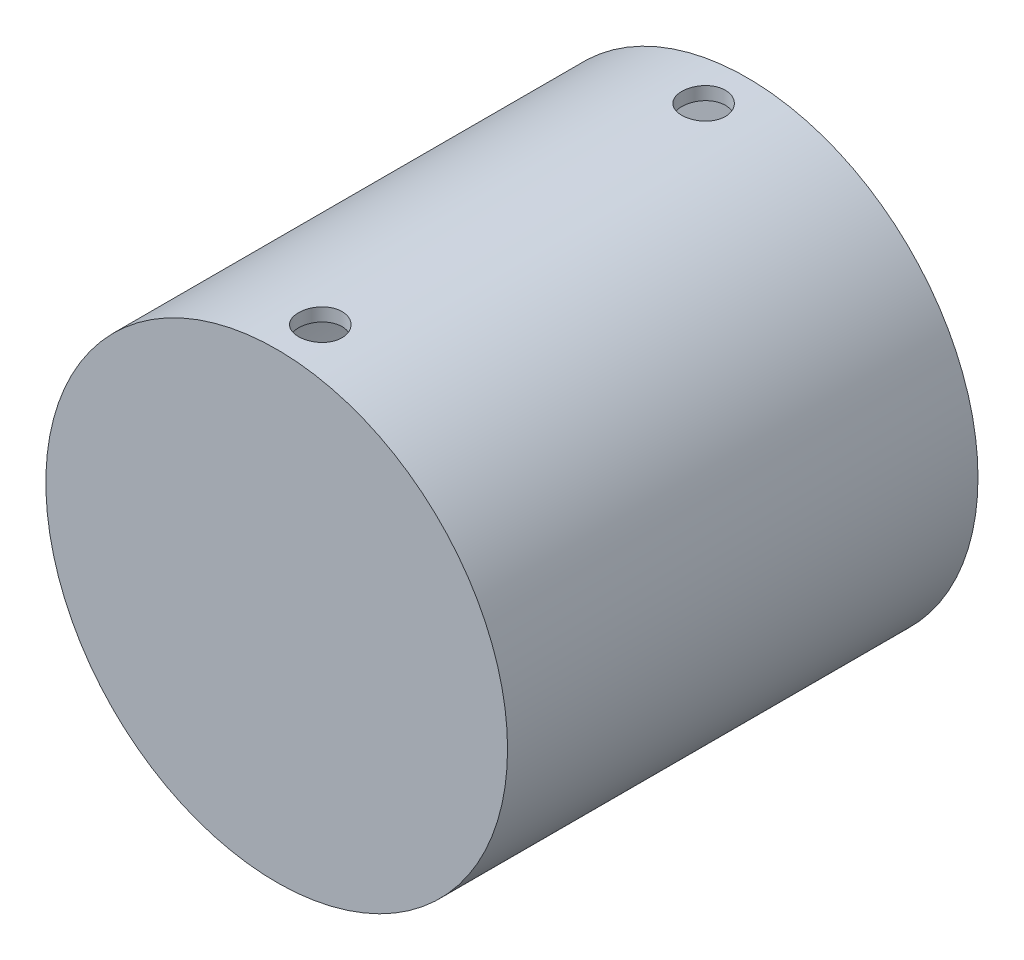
ISO-10303-21;
HEADER;
FILE_DESCRIPTION(('STEP AP214'),'2;1');
FILE_NAME('part.step','',(''),(''),'','','');
FILE_SCHEMA(('AUTOMOTIVE_DESIGN { 1 0 10303 214 1 1 1 1 }'));
ENDSEC;
DATA;
#1=APPLICATION_CONTEXT('core data for automotive mechanical design processes');
#2=APPLICATION_PROTOCOL_DEFINITION('international standard','automotive_design',2000,#1);
#3=PRODUCT_CONTEXT('',#1,'mechanical');
#4=PRODUCT('Part','Part','',(#3));
#5=PRODUCT_RELATED_PRODUCT_CATEGORY('part','',(#4));
#6=PRODUCT_DEFINITION_FORMATION('','',#4);
#7=PRODUCT_DEFINITION_CONTEXT('part definition',#1,'design');
#8=PRODUCT_DEFINITION('design','',#6,#7);
#9=PRODUCT_DEFINITION_SHAPE('','',#8);
#10=(LENGTH_UNIT() NAMED_UNIT(*) SI_UNIT(.MILLI.,.METRE.));
#11=(NAMED_UNIT(*) PLANE_ANGLE_UNIT() SI_UNIT($,.RADIAN.));
#12=(NAMED_UNIT(*) SI_UNIT($,.STERADIAN.) SOLID_ANGLE_UNIT());
#13=UNCERTAINTY_MEASURE_WITH_UNIT(LENGTH_MEASURE(1.E-05),#10,'distance_accuracy_value','');
#14=(GEOMETRIC_REPRESENTATION_CONTEXT(3) GLOBAL_UNCERTAINTY_ASSIGNED_CONTEXT((#13)) GLOBAL_UNIT_ASSIGNED_CONTEXT((#10,
#11,#12)) REPRESENTATION_CONTEXT('',''));
#15=CARTESIAN_POINT('',(0.,0.,0.));
#16=DIRECTION('',(0.,0.,1.));
#17=DIRECTION('',(1.,0.,0.));
#18=AXIS2_PLACEMENT_3D('',#15,#16,#17);
#19=CARTESIAN_POINT('',(0.,0.,-100.));
#20=DIRECTION('',(0.,0.,1.));
#21=DIRECTION('',(1.,0.,0.));
#22=AXIS2_PLACEMENT_3D('',#19,#20,#21);
#23=CYLINDRICAL_SURFACE('',#22,53.);
#24=CARTESIAN_POINT('',(0.,53.,-11.));
#25=CARTESIAN_POINT('',(0.140141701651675,53.0000003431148,-11.0000013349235));
#26=CARTESIAN_POINT('',(0.280262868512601,52.9994430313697,-10.9941058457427));
#27=CARTESIAN_POINT('',(0.559551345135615,52.9972300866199,-10.9705673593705));
#28=CARTESIAN_POINT('',(0.698718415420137,52.9955741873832,-10.9529215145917));
#29=CARTESIAN_POINT('',(0.975171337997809,52.9912084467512,-10.9059878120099));
#30=CARTESIAN_POINT('',(1.11245557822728,52.9884977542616,-10.8766905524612));
#31=CARTESIAN_POINT('',(1.38410498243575,52.9820980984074,-10.8066552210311));
#32=CARTESIAN_POINT('',(1.51846905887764,52.9784087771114,-10.7659129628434));
#33=CARTESIAN_POINT('',(1.78314487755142,52.9701605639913,-10.6733319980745));
#34=CARTESIAN_POINT('',(1.91346039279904,52.965602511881,-10.621504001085));
#35=CARTESIAN_POINT('',(2.16930312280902,52.9557411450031,-10.507079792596));
#36=CARTESIAN_POINT('',(2.2948285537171,52.9504375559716,-10.4444796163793));
#37=CARTESIAN_POINT('',(2.5400873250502,52.9392389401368,-10.3090104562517));
#38=CARTESIAN_POINT('',(2.65982396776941,52.9333442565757,-10.2361474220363));
#39=CARTESIAN_POINT('',(2.89278819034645,52.9211242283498,-10.0806126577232));
#40=CARTESIAN_POINT('',(3.00601334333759,52.9147987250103,-9.99793730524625));
#41=CARTESIAN_POINT('',(3.22538889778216,52.9018806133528,-9.82316403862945));
#42=CARTESIAN_POINT('',(3.33152095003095,52.895287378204,-9.73104313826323));
#43=CARTESIAN_POINT('',(3.53569271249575,52.8820323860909,-9.53816428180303));
#44=CARTESIAN_POINT('',(3.63372941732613,52.8753706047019,-9.43740314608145));
#45=CARTESIAN_POINT('',(3.82094665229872,52.862171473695,-9.22801542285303));
#46=CARTESIAN_POINT('',(3.91013003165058,52.8556340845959,-9.11939138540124));
#47=CARTESIAN_POINT('',(4.07907835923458,52.8428642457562,-8.89497053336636));
#48=CARTESIAN_POINT('',(4.15883981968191,52.8366319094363,-8.77917108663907));
#49=CARTESIAN_POINT('',(4.30845347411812,52.8246426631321,-8.54106803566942));
#50=CARTESIAN_POINT('',(4.37829044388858,52.8188864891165,-8.41875482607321));
#51=CARTESIAN_POINT('',(4.50743436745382,52.8080224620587,-8.16860766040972));
#52=CARTESIAN_POINT('',(4.56673741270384,52.8029148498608,-8.04077167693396));
#53=CARTESIAN_POINT('',(4.67433288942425,52.7934990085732,-7.78056574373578));
#54=CARTESIAN_POINT('',(4.72262957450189,52.7891904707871,-7.64819756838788));
#55=CARTESIAN_POINT('',(4.80790479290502,52.7814916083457,-7.37982401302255));
#56=CARTESIAN_POINT('',(4.84487915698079,52.7781016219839,-7.24381731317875));
#57=CARTESIAN_POINT('',(4.93813690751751,52.7694885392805,-6.83270944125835));
#58=CARTESIAN_POINT('',(4.97719749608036,52.7657822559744,-6.55344700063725));
#59=CARTESIAN_POINT('',(5.00789070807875,52.7628774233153,-5.99245917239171));
#60=CARTESIAN_POINT('',(4.99952444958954,52.7636787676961,-5.71073384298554));
#61=CARTESIAN_POINT('',(4.93577813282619,52.7696797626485,-5.15358850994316));
#62=CARTESIAN_POINT('',(4.88054965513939,52.7748652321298,-4.87815111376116));
#63=CARTESIAN_POINT('',(4.72486582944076,52.7890300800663,-4.34048350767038));
#64=CARTESIAN_POINT('',(4.62440993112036,52.7980095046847,-4.07825345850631));
#65=CARTESIAN_POINT('',(4.38095903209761,52.8187662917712,-3.57395054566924));
#66=CARTESIAN_POINT('',(4.23789649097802,52.8305480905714,-3.33191047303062));
#67=CARTESIAN_POINT('',(3.91334073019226,52.8555783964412,-2.87522048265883));
#68=CARTESIAN_POINT('',(3.73184651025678,52.8688269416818,-2.66057127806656));
#69=CARTESIAN_POINT('',(3.33473153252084,52.8953611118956,-2.26387390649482));
#70=CARTESIAN_POINT('',(3.11897978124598,52.908646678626,-2.08195684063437));
#71=CARTESIAN_POINT('',(2.65992968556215,52.933708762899,-1.75690320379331));
#72=CARTESIAN_POINT('',(2.41663131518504,52.9454852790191,-1.61376666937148));
#73=CARTESIAN_POINT('',(1.90930553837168,52.9662056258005,-1.37034344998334));
#74=CARTESIAN_POINT('',(1.64527506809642,52.975149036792,-1.27006311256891));
#75=CARTESIAN_POINT('',(1.10402142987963,52.9891910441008,-1.11529343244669));
#76=CARTESIAN_POINT('',(0.826798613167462,52.9942897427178,-1.06080287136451));
#77=CARTESIAN_POINT('',(0.268165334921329,53.000054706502,-0.999325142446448));
#78=CARTESIAN_POINT('',(-0.0132250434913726,53.0007378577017,-0.992157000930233));
#79=CARTESIAN_POINT('',(-0.573203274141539,52.9976399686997,-1.02505271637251));
#80=CARTESIAN_POINT('',(-0.85179115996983,52.9938589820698,-1.06511600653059));
#81=CARTESIAN_POINT('',(-1.39773625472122,52.9822686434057,-1.1911872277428));
#82=CARTESIAN_POINT('',(-1.66511313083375,52.9744666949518,-1.27711072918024));
#83=CARTESIAN_POINT('',(-2.18165692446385,52.9557101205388,-1.4923768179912));
#84=CARTESIAN_POINT('',(-2.43082347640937,52.9447554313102,-1.62172027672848));
#85=CARTESIAN_POINT('',(-2.90469389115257,52.9208775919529,-1.92060539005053));
#86=CARTESIAN_POINT('',(-3.12932223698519,52.9079486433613,-2.09026630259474));
#87=CARTESIAN_POINT('',(-3.54697610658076,52.8815926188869,-2.46479982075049));
#88=CARTESIAN_POINT('',(-3.74000092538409,52.8681655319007,-2.66967321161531));
#89=CARTESIAN_POINT('',(-4.08959449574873,52.8422759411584,-3.10960043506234));
#90=CARTESIAN_POINT('',(-4.24604471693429,52.8298166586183,-3.34474866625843));
#91=CARTESIAN_POINT('',(-4.5172325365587,52.8073215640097,-3.83809742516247));
#92=CARTESIAN_POINT('',(-4.63197065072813,52.797285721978,-4.09629766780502));
#93=CARTESIAN_POINT('',(-4.81628292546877,52.7807920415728,-4.62795746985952));
#94=CARTESIAN_POINT('',(-4.8859283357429,52.7743285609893,-4.9013922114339));
#95=CARTESIAN_POINT('',(-4.97828978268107,52.7656979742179,-5.45629207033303));
#96=CARTESIAN_POINT('',(-5.00100700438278,52.76353075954,-5.73775698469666));
#97=CARTESIAN_POINT('',(-4.99944473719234,52.7636752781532,-6.15898206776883));
#98=CARTESIAN_POINT('',(-4.99301883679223,52.7642860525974,-6.29902872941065));
#99=CARTESIAN_POINT('',(-4.9684421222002,52.7666065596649,-6.57806624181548));
#100=CARTESIAN_POINT('',(-4.95029565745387,52.76831588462,-6.71705746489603));
#101=CARTESIAN_POINT('',(-4.90239591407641,52.7727873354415,-6.99305036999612));
#102=CARTESIAN_POINT('',(-4.87263837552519,52.7755498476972,-7.13005130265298));
#103=CARTESIAN_POINT('',(-4.80174860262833,52.7820469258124,-7.40100314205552));
#104=CARTESIAN_POINT('',(-4.76062053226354,52.7857811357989,-7.53495514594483));
#105=CARTESIAN_POINT('',(-4.66726936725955,52.7941170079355,-7.79894527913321));
#106=CARTESIAN_POINT('',(-4.61504344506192,52.7987188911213,-7.92898240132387));
#107=CARTESIAN_POINT('',(-4.49989878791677,52.8086569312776,-8.18414634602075));
#108=CARTESIAN_POINT('',(-4.436983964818,52.8139928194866,-8.30927494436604));
#109=CARTESIAN_POINT('',(-4.30087198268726,52.8252511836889,-8.55383861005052));
#110=CARTESIAN_POINT('',(-4.22767121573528,52.8311738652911,-8.67327165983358));
#111=CARTESIAN_POINT('',(-4.07155037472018,52.8434348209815,-8.90552041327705));
#112=CARTESIAN_POINT('',(-3.98863384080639,52.8497729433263,-9.01833850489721));
#113=CARTESIAN_POINT('',(-3.81328003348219,52.86271515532,-9.237070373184));
#114=CARTESIAN_POINT('',(-3.72080478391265,52.8693202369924,-9.34295364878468));
#115=CARTESIAN_POINT('',(-3.52730752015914,52.8825821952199,-9.54652151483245));
#116=CARTESIAN_POINT('',(-3.42628864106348,52.8892390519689,-9.64420908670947));
#117=CARTESIAN_POINT('',(-3.21632048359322,52.9024229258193,-9.83079887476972));
#118=CARTESIAN_POINT('',(-3.10736641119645,52.9089498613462,-9.91969570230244));
#119=CARTESIAN_POINT('',(-2.88238980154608,52.9216828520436,-10.0879769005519));
#120=CARTESIAN_POINT('',(-2.76636988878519,52.9278890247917,-10.1673647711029));
#121=CARTESIAN_POINT('',(-2.52772365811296,52.9398235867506,-10.3163003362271));
#122=CARTESIAN_POINT('',(-2.40508062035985,52.9455506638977,-10.3858213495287));
#123=CARTESIAN_POINT('',(-2.15438721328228,52.9563438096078,-10.514249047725));
#124=CARTESIAN_POINT('',(-2.02633884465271,52.961410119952,-10.5731596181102));
#125=CARTESIAN_POINT('',(-1.76580681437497,52.9707362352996,-10.679928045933));
#126=CARTESIAN_POINT('',(-1.63332692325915,52.9749967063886,-10.7277950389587));
#127=CARTESIAN_POINT('',(-1.36482159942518,52.9825943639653,-10.812179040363));
#128=CARTESIAN_POINT('',(-1.22879705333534,52.9859317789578,-10.8486988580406));
#129=CARTESIAN_POINT('',(-0.912528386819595,52.9924454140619,-10.9194397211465));
#130=CARTESIAN_POINT('',(-0.731358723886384,52.9952672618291,-10.9496211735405));
#131=CARTESIAN_POINT('',(-0.366780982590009,52.9990443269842,-10.9899004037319));
#132=CARTESIAN_POINT('',(-0.183372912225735,52.9999995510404,-10.9999982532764));
#133=CARTESIAN_POINT('',(0.,53.,-11.));
#134=B_SPLINE_CURVE_WITH_KNOTS('',3,(#24,#25,#26,#27,#28,#29,#30,#31,#32,#33,#34,#35,#36,#37,
#38,#39,#40,#41,#42,#43,#44,#45,#46,#47,#48,#49,#50,#51,#52,#53,#54,#55,#56,#57,#58,#59,#60,#61,
#62,#63,#64,#65,#66,#67,#68,#69,#70,#71,#72,#73,#74,#75,#76,#77,#78,#79,#80,#81,#82,#83,#84,#85,
#86,#87,#88,#89,#90,#91,#92,#93,#94,#95,#96,#97,#98,#99,#100,#101,#102,#103,#104,#105,#106,#107,
#108,#109,#110,#111,#112,#113,#114,#115,#116,#117,#118,#119,#120,#121,#122,#123,#124,#125,#126,
#127,#128,#129,#130,#131,#132,#133),.UNSPECIFIED.,.T.,.F.,(4,2,2,2,2,2,2,2,2,2,2,2,2,2,2,2,2,2,
2,2,2,2,2,2,2,2,2,2,2,2,2,2,2,2,2,2,2,2,2,2,2,2,2,2,2,2,2,2,2,2,2,2,2,2,4),(0.,
0.420264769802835,0.840631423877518,1.26133797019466,1.68219860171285,2.10265447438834,
2.52326542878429,2.94363353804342,3.36415731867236,3.78572991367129,4.20745831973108,
4.62905056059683,5.05079837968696,5.47318633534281,5.89573068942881,6.31811146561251,
6.74064758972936,7.58227862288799,8.42388981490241,9.262789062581,10.1016985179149,
10.9419449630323,11.7822132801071,12.6257756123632,13.4693387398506,14.3130267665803,
15.1566923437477,15.9971296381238,16.8375568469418,17.6764421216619,18.5153442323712,
19.3567593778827,20.198193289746,21.0423174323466,21.8864311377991,22.7292078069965,
23.5719631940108,23.992140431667,24.4121618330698,24.8323374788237,25.2523594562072,
25.672488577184,26.0924642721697,26.5125876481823,26.9325584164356,27.354266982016,
27.7758214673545,28.1976327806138,28.6192883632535,29.0420632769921,29.4646830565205,
29.8869519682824,30.3091162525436,30.8590271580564,31.4089360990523),.UNSPECIFIED.);
#135=CARTESIAN_POINT('',(0.,53.,-11.));
#136=VERTEX_POINT('',#135);
#137=EDGE_CURVE('E73',#136,#136,#134,.T.);
#138=ORIENTED_EDGE('',*,*,#137,.T.);
#139=EDGE_LOOP('',(#138));
#140=FACE_BOUND('',#139,.T.);
#141=CARTESIAN_POINT('',(0.,0.,4.));
#142=DIRECTION('',(0.,0.,1.));
#143=DIRECTION('',(1.,0.,0.));
#144=AXIS2_PLACEMENT_3D('',#141,#142,#143);
#145=CIRCLE('',#144,53.);
#146=CARTESIAN_POINT('',(53.,0.,4.));
#147=VERTEX_POINT('',#146);
#148=EDGE_CURVE('E56',#147,#147,#145,.T.);
#149=ORIENTED_EDGE('',*,*,#148,.F.);
#150=EDGE_LOOP('',(#149));
#151=FACE_BOUND('',#150,.T.);
#152=CARTESIAN_POINT('',(0.,0.,-104.));
#153=DIRECTION('',(0.,0.,-1.));
#154=DIRECTION('',(-1.,0.,0.));
#155=AXIS2_PLACEMENT_3D('',#152,#153,#154);
#156=CIRCLE('',#155,53.);
#157=CARTESIAN_POINT('',(-53.,0.,-104.));
#158=VERTEX_POINT('',#157);
#159=EDGE_CURVE('E64',#158,#158,#156,.T.);
#160=ORIENTED_EDGE('',*,*,#159,.F.);
#161=EDGE_LOOP('',(#160));
#162=FACE_BOUND('',#161,.T.);
#163=CARTESIAN_POINT('',(0.,53.,-99.));
#164=CARTESIAN_POINT('',(0.140141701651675,53.0000003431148,-99.0000013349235));
#165=CARTESIAN_POINT('',(0.280262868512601,52.9994430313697,-98.9941058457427));
#166=CARTESIAN_POINT('',(0.559551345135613,52.9972300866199,-98.9705673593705));
#167=CARTESIAN_POINT('',(0.698718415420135,52.9955741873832,-98.9529215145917));
#168=CARTESIAN_POINT('',(0.975171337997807,52.9912084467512,-98.9059878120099));
#169=CARTESIAN_POINT('',(1.11245557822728,52.9884977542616,-98.8766905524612));
#170=CARTESIAN_POINT('',(1.38410498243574,52.9820980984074,-98.8066552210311));
#171=CARTESIAN_POINT('',(1.51846905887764,52.9784087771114,-98.7659129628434));
#172=CARTESIAN_POINT('',(1.78314487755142,52.9701605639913,-98.6733319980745));
#173=CARTESIAN_POINT('',(1.91346039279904,52.965602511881,-98.621504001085));
#174=CARTESIAN_POINT('',(2.16930312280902,52.9557411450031,-98.507079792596));
#175=CARTESIAN_POINT('',(2.29482855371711,52.9504375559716,-98.4444796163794));
#176=CARTESIAN_POINT('',(2.5400873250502,52.9392389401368,-98.3090104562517));
#177=CARTESIAN_POINT('',(2.65982396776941,52.9333442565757,-98.2361474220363));
#178=CARTESIAN_POINT('',(2.89278819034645,52.9211242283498,-98.0806126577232));
#179=CARTESIAN_POINT('',(3.00601334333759,52.9147987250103,-97.9979373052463));
#180=CARTESIAN_POINT('',(3.22538889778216,52.9018806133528,-97.8231640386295));
#181=CARTESIAN_POINT('',(3.33152095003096,52.895287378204,-97.7310431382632));
#182=CARTESIAN_POINT('',(3.53569271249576,52.8820323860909,-97.538164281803));
#183=CARTESIAN_POINT('',(3.63372941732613,52.8753706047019,-97.4374031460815));
#184=CARTESIAN_POINT('',(3.82094665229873,52.862171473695,-97.228015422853));
#185=CARTESIAN_POINT('',(3.91013003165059,52.8556340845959,-97.1193913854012));
#186=CARTESIAN_POINT('',(4.07907835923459,52.8428642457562,-96.8949705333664));
#187=CARTESIAN_POINT('',(4.15883981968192,52.8366319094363,-96.7791710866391));
#188=CARTESIAN_POINT('',(4.30845347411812,52.8246426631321,-96.5410680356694));
#189=CARTESIAN_POINT('',(4.37829044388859,52.8188864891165,-96.4187548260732));
#190=CARTESIAN_POINT('',(4.50743436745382,52.8080224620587,-96.1686076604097));
#191=CARTESIAN_POINT('',(4.56673741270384,52.8029148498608,-96.040771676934));
#192=CARTESIAN_POINT('',(4.67433288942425,52.7934990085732,-95.7805657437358));
#193=CARTESIAN_POINT('',(4.72262957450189,52.7891904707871,-95.6481975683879));
#194=CARTESIAN_POINT('',(4.80790479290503,52.7814916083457,-95.3798240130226));
#195=CARTESIAN_POINT('',(4.84487915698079,52.7781016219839,-95.2438173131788));
#196=CARTESIAN_POINT('',(4.93813690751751,52.7694885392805,-94.8327094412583));
#197=CARTESIAN_POINT('',(4.97719749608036,52.7657822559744,-94.5534470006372));
#198=CARTESIAN_POINT('',(5.00789070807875,52.7628774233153,-93.9924591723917));
#199=CARTESIAN_POINT('',(4.99952444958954,52.7636787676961,-93.7107338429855));
#200=CARTESIAN_POINT('',(4.93577813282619,52.7696797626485,-93.1535885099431));
#201=CARTESIAN_POINT('',(4.88054965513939,52.7748652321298,-92.8781511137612));
#202=CARTESIAN_POINT('',(4.72486582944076,52.7890300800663,-92.3404835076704));
#203=CARTESIAN_POINT('',(4.62440993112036,52.7980095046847,-92.0782534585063));
#204=CARTESIAN_POINT('',(4.38095903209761,52.8187662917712,-91.5739505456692));
#205=CARTESIAN_POINT('',(4.23789649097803,52.8305480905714,-91.3319104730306));
#206=CARTESIAN_POINT('',(3.91334073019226,52.8555783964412,-90.8752204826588));
#207=CARTESIAN_POINT('',(3.73184651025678,52.8688269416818,-90.6605712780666));
#208=CARTESIAN_POINT('',(3.33473153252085,52.8953611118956,-90.2638739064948));
#209=CARTESIAN_POINT('',(3.11897978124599,52.908646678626,-90.0819568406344));
#210=CARTESIAN_POINT('',(2.65992968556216,52.933708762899,-89.7569032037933));
#211=CARTESIAN_POINT('',(2.41663131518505,52.9454852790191,-89.6137666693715));
#212=CARTESIAN_POINT('',(1.9093055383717,52.9662056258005,-89.3703434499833));
#213=CARTESIAN_POINT('',(1.64527506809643,52.975149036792,-89.2700631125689));
#214=CARTESIAN_POINT('',(1.10402142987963,52.9891910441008,-89.1152934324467));
#215=CARTESIAN_POINT('',(0.82679861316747,52.9942897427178,-89.0608028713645));
#216=CARTESIAN_POINT('',(0.268165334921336,53.000054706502,-88.9993251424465));
#217=CARTESIAN_POINT('',(-0.0132250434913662,53.0007378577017,-88.9921570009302));
#218=CARTESIAN_POINT('',(-0.573203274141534,52.9976399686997,-89.0250527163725));
#219=CARTESIAN_POINT('',(-0.851791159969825,52.9938589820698,-89.0651160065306));
#220=CARTESIAN_POINT('',(-1.39773625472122,52.9822686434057,-89.1911872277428));
#221=CARTESIAN_POINT('',(-1.66511313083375,52.9744666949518,-89.2771107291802));
#222=CARTESIAN_POINT('',(-2.18165692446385,52.9557101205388,-89.4923768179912));
#223=CARTESIAN_POINT('',(-2.43082347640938,52.9447554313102,-89.6217202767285));
#224=CARTESIAN_POINT('',(-2.90469389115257,52.9208775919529,-89.9206053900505));
#225=CARTESIAN_POINT('',(-3.12932223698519,52.9079486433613,-90.0902663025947));
#226=CARTESIAN_POINT('',(-3.54697610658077,52.8815926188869,-90.4647998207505));
#227=CARTESIAN_POINT('',(-3.7400009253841,52.8681655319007,-90.6696732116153));
#228=CARTESIAN_POINT('',(-4.08959449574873,52.8422759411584,-91.1096004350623));
#229=CARTESIAN_POINT('',(-4.24604471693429,52.8298166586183,-91.3447486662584));
#230=CARTESIAN_POINT('',(-4.5172325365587,52.8073215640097,-91.8380974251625));
#231=CARTESIAN_POINT('',(-4.63197065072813,52.797285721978,-92.096297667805));
#232=CARTESIAN_POINT('',(-4.81628292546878,52.7807920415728,-92.6279574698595));
#233=CARTESIAN_POINT('',(-4.88592833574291,52.7743285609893,-92.9013922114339));
#234=CARTESIAN_POINT('',(-4.97828978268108,52.7656979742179,-93.456292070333));
#235=CARTESIAN_POINT('',(-5.00100700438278,52.76353075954,-93.7377569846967));
#236=CARTESIAN_POINT('',(-4.99944473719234,52.7636752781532,-94.1589820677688));
#237=CARTESIAN_POINT('',(-4.99301883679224,52.7642860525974,-94.2990287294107));
#238=CARTESIAN_POINT('',(-4.9684421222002,52.7666065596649,-94.5780662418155));
#239=CARTESIAN_POINT('',(-4.95029565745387,52.76831588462,-94.717057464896));
#240=CARTESIAN_POINT('',(-4.90239591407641,52.7727873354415,-94.9930503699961));
#241=CARTESIAN_POINT('',(-4.87263837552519,52.7755498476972,-95.130051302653));
#242=CARTESIAN_POINT('',(-4.80174860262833,52.7820469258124,-95.4010031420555));
#243=CARTESIAN_POINT('',(-4.76062053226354,52.7857811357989,-95.5349551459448));
#244=CARTESIAN_POINT('',(-4.66726936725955,52.7941170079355,-95.7989452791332));
#245=CARTESIAN_POINT('',(-4.61504344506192,52.7987188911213,-95.9289824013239));
#246=CARTESIAN_POINT('',(-4.49989878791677,52.8086569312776,-96.1841463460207));
#247=CARTESIAN_POINT('',(-4.43698396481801,52.8139928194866,-96.309274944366));
#248=CARTESIAN_POINT('',(-4.30087198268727,52.8252511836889,-96.5538386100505));
#249=CARTESIAN_POINT('',(-4.22767121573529,52.8311738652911,-96.6732716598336));
#250=CARTESIAN_POINT('',(-4.07155037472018,52.8434348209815,-96.905520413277));
#251=CARTESIAN_POINT('',(-3.9886338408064,52.8497729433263,-97.0183385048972));
#252=CARTESIAN_POINT('',(-3.8132800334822,52.86271515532,-97.237070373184));
#253=CARTESIAN_POINT('',(-3.72080478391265,52.8693202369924,-97.3429536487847));
#254=CARTESIAN_POINT('',(-3.52730752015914,52.8825821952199,-97.5465215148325));
#255=CARTESIAN_POINT('',(-3.42628864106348,52.8892390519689,-97.6442090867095));
#256=CARTESIAN_POINT('',(-3.21632048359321,52.9024229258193,-97.8307988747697));
#257=CARTESIAN_POINT('',(-3.10736641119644,52.9089498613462,-97.9196957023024));
#258=CARTESIAN_POINT('',(-2.88238980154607,52.9216828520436,-98.0879769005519));
#259=CARTESIAN_POINT('',(-2.76636988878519,52.9278890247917,-98.1673647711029));
#260=CARTESIAN_POINT('',(-2.52772365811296,52.9398235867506,-98.3163003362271));
#261=CARTESIAN_POINT('',(-2.40508062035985,52.9455506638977,-98.3858213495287));
#262=CARTESIAN_POINT('',(-2.15438721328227,52.9563438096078,-98.514249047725));
#263=CARTESIAN_POINT('',(-2.02633884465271,52.961410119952,-98.5731596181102));
#264=CARTESIAN_POINT('',(-1.76580681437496,52.9707362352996,-98.679928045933));
#265=CARTESIAN_POINT('',(-1.63332692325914,52.9749967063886,-98.7277950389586));
#266=CARTESIAN_POINT('',(-1.36482159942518,52.9825943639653,-98.812179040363));
#267=CARTESIAN_POINT('',(-1.22879705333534,52.9859317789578,-98.8486988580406));
#268=CARTESIAN_POINT('',(-0.912528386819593,52.9924454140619,-98.9194397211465));
#269=CARTESIAN_POINT('',(-0.731358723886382,52.9952672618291,-98.9496211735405));
#270=CARTESIAN_POINT('',(-0.366780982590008,52.9990443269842,-98.9899004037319));
#271=CARTESIAN_POINT('',(-0.183372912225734,52.9999995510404,-98.9999982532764));
#272=CARTESIAN_POINT('',(0.,53.,-99.));
#273=B_SPLINE_CURVE_WITH_KNOTS('',3,(#163,#164,#165,#166,#167,#168,#169,#170,#171,#172,#173,
#174,#175,#176,#177,#178,#179,#180,#181,#182,#183,#184,#185,#186,#187,#188,#189,#190,#191,#192,
#193,#194,#195,#196,#197,#198,#199,#200,#201,#202,#203,#204,#205,#206,#207,#208,#209,#210,#211,
#212,#213,#214,#215,#216,#217,#218,#219,#220,#221,#222,#223,#224,#225,#226,#227,#228,#229,#230,
#231,#232,#233,#234,#235,#236,#237,#238,#239,#240,#241,#242,#243,#244,#245,#246,#247,#248,#249,
#250,#251,#252,#253,#254,#255,#256,#257,#258,#259,#260,#261,#262,#263,#264,#265,#266,#267,#268,
#269,#270,#271,#272),.UNSPECIFIED.,.T.,.F.,(4,2,2,2,2,2,2,2,2,2,2,2,2,2,2,2,2,2,2,2,2,2,2,2,2,2,
2,2,2,2,2,2,2,2,2,2,2,2,2,2,2,2,2,2,2,2,2,2,2,2,2,2,2,2,4),(0.,0.420264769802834,
0.840631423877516,1.26133797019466,1.68219860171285,2.10265447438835,2.52326542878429,
2.94363353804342,3.36415731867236,3.7857299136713,4.20745831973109,4.62905056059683,
5.05079837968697,5.47318633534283,5.89573068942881,6.3181114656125,6.74064758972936,
7.58227862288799,8.42388981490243,9.262789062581,10.1016985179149,10.9419449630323,
11.7822132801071,12.6257756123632,13.4693387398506,14.3130267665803,15.1566923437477,
15.9971296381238,16.8375568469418,17.6764421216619,18.5153442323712,19.3567593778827,
20.198193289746,21.0423174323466,21.8864311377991,22.7292078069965,23.5719631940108,
23.992140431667,24.4121618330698,24.8323374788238,25.2523594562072,25.672488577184,
26.0924642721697,26.5125876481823,26.9325584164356,27.3542669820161,27.7758214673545,
28.1976327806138,28.6192883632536,29.0420632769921,29.4646830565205,29.8869519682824,
30.3091162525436,30.8590271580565,31.4089360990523),.UNSPECIFIED.);
#274=CARTESIAN_POINT('',(0.,53.,-99.));
#275=VERTEX_POINT('',#274);
#276=EDGE_CURVE('E95',#275,#275,#273,.T.);
#277=ORIENTED_EDGE('',*,*,#276,.T.);
#278=EDGE_LOOP('',(#277));
#279=FACE_BOUND('',#278,.T.);
#280=ADVANCED_FACE('F37',(#140,#151,#162,#279),#23,.T.);
#281=CARTESIAN_POINT('',(0.,0.,-100.));
#282=DIRECTION('',(0.,0.,1.));
#283=DIRECTION('',(1.,0.,0.));
#284=AXIS2_PLACEMENT_3D('',#281,#282,#283);
#285=CYLINDRICAL_SURFACE('',#284,50.);
#286=CARTESIAN_POINT('',(0.,0.,-100.));
#287=DIRECTION('',(0.,0.,1.));
#288=DIRECTION('',(1.,0.,0.));
#289=AXIS2_PLACEMENT_3D('',#286,#287,#288);
#290=CIRCLE('',#289,50.);
#291=CARTESIAN_POINT('',(50.,0.,-100.));
#292=VERTEX_POINT('',#291);
#293=EDGE_CURVE('E10',#292,#292,#290,.T.);
#294=ORIENTED_EDGE('',*,*,#293,.F.);
#295=EDGE_LOOP('',(#294));
#296=FACE_BOUND('',#295,.T.);
#297=CARTESIAN_POINT('',(0.,0.,0.));
#298=DIRECTION('',(0.,0.,1.));
#299=DIRECTION('',(1.,0.,0.));
#300=AXIS2_PLACEMENT_3D('',#297,#298,#299);
#301=CIRCLE('',#300,50.);
#302=CARTESIAN_POINT('',(50.,0.,0.));
#303=VERTEX_POINT('',#302);
#304=EDGE_CURVE('E50',#303,#303,#301,.T.);
#305=ORIENTED_EDGE('',*,*,#304,.T.);
#306=EDGE_LOOP('',(#305));
#307=FACE_BOUND('',#306,.T.);
#308=CARTESIAN_POINT('',(0.,50.,-11.));
#309=CARTESIAN_POINT('',(0.140100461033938,50.0000003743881,-11.0000013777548));
#310=CARTESIAN_POINT('',(0.280179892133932,49.9994099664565,-10.9941093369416));
#311=CARTESIAN_POINT('',(0.559384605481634,49.9970656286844,-10.9705849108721));
#312=CARTESIAN_POINT('',(0.698509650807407,49.9953114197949,-10.9529497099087));
#313=CARTESIAN_POINT('',(0.974876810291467,49.990686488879,-10.9060450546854));
#314=CARTESIAN_POINT('',(1.11211733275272,49.9878148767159,-10.8767663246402));
#315=CARTESIAN_POINT('',(1.38367953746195,49.9810352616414,-10.806776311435));
#316=CARTESIAN_POINT('',(1.51800013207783,49.9771268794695,-10.7660608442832));
#317=CARTESIAN_POINT('',(1.78258815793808,49.968388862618,-10.673542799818));
#318=CARTESIAN_POINT('',(1.9128594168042,49.9635601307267,-10.6217510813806));
#319=CARTESIAN_POINT('',(2.16861600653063,49.9531129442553,-10.5074087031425));
#320=CARTESIAN_POINT('',(2.29409955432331,49.9474941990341,-10.4448540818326));
#321=CARTESIAN_POINT('',(2.53927920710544,49.9356297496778,-10.3094848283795));
#322=CARTESIAN_POINT('',(2.65897858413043,49.9293844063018,-10.2366760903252));
#323=CARTESIAN_POINT('',(2.89187409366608,49.9164369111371,-10.0812584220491));
#324=CARTESIAN_POINT('',(3.00506780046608,49.90973459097,-9.99864587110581));
#325=CARTESIAN_POINT('',(3.22442516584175,49.8960438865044,-9.82397629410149));
#326=CARTESIAN_POINT('',(3.33056800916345,49.8890547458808,-9.73189318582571));
#327=CARTESIAN_POINT('',(3.53476522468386,49.8750029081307,-9.53909021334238));
#328=CARTESIAN_POINT('',(3.6328165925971,49.8679401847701,-9.43836716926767));
#329=CARTESIAN_POINT('',(3.82006793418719,49.853945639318,-9.22905453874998));
#330=CARTESIAN_POINT('',(3.90927074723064,49.8470137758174,-9.1204674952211));
#331=CARTESIAN_POINT('',(4.07826305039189,49.8334722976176,-8.89611823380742));
#332=CARTESIAN_POINT('',(4.15804905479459,49.8268628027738,-8.78035338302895));
#333=CARTESIAN_POINT('',(4.30773494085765,49.8141453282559,-8.54228707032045));
#334=CARTESIAN_POINT('',(4.37761719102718,49.8080382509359,-8.4199744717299));
#335=CARTESIAN_POINT('',(4.50685113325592,49.796510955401,-8.16982101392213));
#336=CARTESIAN_POINT('',(4.56619891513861,49.7910909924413,-8.0419781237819));
#337=CARTESIAN_POINT('',(4.67388203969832,49.7810984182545,-7.78175094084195));
#338=CARTESIAN_POINT('',(4.72222165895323,49.7765254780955,-7.64936843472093));
#339=CARTESIAN_POINT('',(4.80757979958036,49.7683532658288,-7.38095897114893));
#340=CARTESIAN_POINT('',(4.84459415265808,49.7647543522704,-7.24493069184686));
#341=CARTESIAN_POINT('',(4.93794230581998,49.7556112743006,-6.83384947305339));
#342=CARTESIAN_POINT('',(4.97706409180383,49.7516744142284,-6.55462957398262));
#343=CARTESIAN_POINT('',(5.00789059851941,49.7485802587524,-5.99371322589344));
#344=CARTESIAN_POINT('',(4.9995965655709,49.7494228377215,-5.71201684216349));
#345=CARTESIAN_POINT('',(4.93601762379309,49.7557708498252,-5.15503476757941));
#346=CARTESIAN_POINT('',(4.88090320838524,49.7612593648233,-4.87972953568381));
#347=CARTESIAN_POINT('',(4.72549673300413,49.7762565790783,-4.34230715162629));
#348=CARTESIAN_POINT('',(4.62520406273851,49.7857653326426,-4.08019017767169));
#349=CARTESIAN_POINT('',(4.38210419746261,49.8077505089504,-3.57603287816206));
#350=CARTESIAN_POINT('',(4.23922134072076,49.8202322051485,-3.33402927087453));
#351=CARTESIAN_POINT('',(3.91505020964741,49.846752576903,-2.87737370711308));
#352=CARTESIAN_POINT('',(3.73376081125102,49.8607912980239,-2.6627225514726));
#353=CARTESIAN_POINT('',(3.33697054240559,49.8889192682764,-2.26587308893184));
#354=CARTESIAN_POINT('',(3.12132238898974,49.9030084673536,-2.08382200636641));
#355=CARTESIAN_POINT('',(2.66244741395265,49.9295914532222,-1.7584818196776));
#356=CARTESIAN_POINT('',(2.41922056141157,49.9420852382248,-1.61519275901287));
#357=CARTESIAN_POINT('',(1.91199052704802,49.9640737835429,-1.37144990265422));
#358=CARTESIAN_POINT('',(1.64798373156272,49.9735680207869,-1.27100357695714));
#359=CARTESIAN_POINT('',(1.10673608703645,49.988482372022,-1.11590541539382));
#360=CARTESIAN_POINT('',(0.829495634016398,49.9939026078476,-1.0612522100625));
#361=CARTESIAN_POINT('',(0.270925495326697,50.0000425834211,-0.999478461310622));
#362=CARTESIAN_POINT('',(-0.0103815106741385,50.000782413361,-0.992154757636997));
#363=CARTESIAN_POINT('',(-0.57021896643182,49.9975320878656,-1.02471431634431));
#364=CARTESIAN_POINT('',(-0.848749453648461,49.993541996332,-1.06459694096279));
#365=CARTESIAN_POINT('',(-1.39454103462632,49.9812930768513,-1.19026847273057));
#366=CARTESIAN_POINT('',(-1.66182424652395,49.9730430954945,-1.27596225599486));
#367=CARTESIAN_POINT('',(-2.17822160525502,49.953199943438,-1.49072588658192));
#368=CARTESIAN_POINT('',(-2.42733534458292,49.9416066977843,-1.61979670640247));
#369=CARTESIAN_POINT('',(-2.90124090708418,49.9163237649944,-1.91815413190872));
#370=CARTESIAN_POINT('',(-3.12594832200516,49.9026271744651,-2.08757421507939));
#371=CARTESIAN_POINT('',(-3.54380809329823,49.8746966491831,-2.46163056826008));
#372=CARTESIAN_POINT('',(-3.73695965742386,49.8604627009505,-2.66626772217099));
#373=CARTESIAN_POINT('',(-4.08693063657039,49.8330011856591,-3.10583201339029));
#374=CARTESIAN_POINT('',(-4.2436167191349,49.8197774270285,-3.34086556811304));
#375=CARTESIAN_POINT('',(-4.51529096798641,49.7958917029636,-3.83404001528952));
#376=CARTESIAN_POINT('',(-4.63027970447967,49.7852297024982,-4.09218059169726));
#377=CARTESIAN_POINT('',(-4.81507725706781,49.7676970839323,-4.62373172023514));
#378=CARTESIAN_POINT('',(-4.88496539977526,49.7608198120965,-4.89711453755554));
#379=CARTESIAN_POINT('',(-4.97781551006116,49.7516193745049,-5.45196065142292));
#380=CARTESIAN_POINT('',(-5.0007788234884,49.7492960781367,-5.73342371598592));
#381=CARTESIAN_POINT('',(-4.99958027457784,49.7494127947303,-6.15460728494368));
#382=CARTESIAN_POINT('',(-4.99328044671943,49.7500479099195,-6.29459925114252));
#383=CARTESIAN_POINT('',(-4.96896519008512,49.7524830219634,-6.57353777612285));
#384=CARTESIAN_POINT('',(-4.9509541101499,49.754282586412,-6.71248470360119));
#385=CARTESIAN_POINT('',(-4.9033339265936,49.7589979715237,-6.98839956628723));
#386=CARTESIAN_POINT('',(-4.87372057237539,49.7619142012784,-7.12536675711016));
#387=CARTESIAN_POINT('',(-4.80312740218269,49.7687776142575,-7.39626233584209));
#388=CARTESIAN_POINT('',(-4.7621517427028,49.7727244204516,-7.53019181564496));
#389=CARTESIAN_POINT('',(-4.66911475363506,49.7815382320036,-7.79414455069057));
#390=CARTESIAN_POINT('',(-4.6170509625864,49.7864054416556,-7.92416693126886));
#391=CARTESIAN_POINT('',(-4.50223825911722,49.7969192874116,-8.17931501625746));
#392=CARTESIAN_POINT('',(-4.43949325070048,49.8025656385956,-8.30444248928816));
#393=CARTESIAN_POINT('',(-4.30372744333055,49.8144815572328,-8.54901935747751));
#394=CARTESIAN_POINT('',(-4.23070301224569,49.82075134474,-8.66846672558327));
#395=CARTESIAN_POINT('',(-4.07493978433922,49.8337332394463,-8.90076102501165));
#396=CARTESIAN_POINT('',(-3.99220451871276,49.8404451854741,-9.01361033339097));
#397=CARTESIAN_POINT('',(-3.81717528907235,49.8541564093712,-9.23247543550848));
#398=CARTESIAN_POINT('',(-3.72483897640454,49.8611568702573,-9.33845729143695));
#399=CARTESIAN_POINT('',(-3.53161206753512,49.8752152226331,-9.54223440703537));
#400=CARTESIAN_POINT('',(-3.43072460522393,49.8822730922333,-9.64003264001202));
#401=CARTESIAN_POINT('',(-3.2210100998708,49.8962537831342,-9.82685596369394));
#402=CARTESIAN_POINT('',(-3.11217826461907,49.9031765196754,-9.91587568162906));
#403=CARTESIAN_POINT('',(-2.88743471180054,49.9166844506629,-10.0844145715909));
#404=CARTESIAN_POINT('',(-2.77152562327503,49.9232697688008,-10.1639372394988));
#405=CARTESIAN_POINT('',(-2.53305926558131,49.9359380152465,-10.3131718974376));
#406=CARTESIAN_POINT('',(-2.41048371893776,49.9420194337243,-10.3828548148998));
#407=CARTESIAN_POINT('',(-2.15990777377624,49.9534835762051,-10.511610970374));
#408=CARTESIAN_POINT('',(-2.03190938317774,49.9588665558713,-10.5706880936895));
#409=CARTESIAN_POINT('',(-1.7714580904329,49.9687792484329,-10.67779263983));
#410=CARTESIAN_POINT('',(-1.63900893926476,49.9733096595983,-10.7258291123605));
#411=CARTESIAN_POINT('',(-1.37054695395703,49.9813929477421,-10.8105524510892));
#412=CARTESIAN_POINT('',(-1.23453500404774,49.9849460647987,-10.8472421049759));
#413=CARTESIAN_POINT('',(-0.917364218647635,49.9919068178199,-10.9185766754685));
#414=CARTESIAN_POINT('',(-0.73525026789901,49.9949297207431,-10.9490810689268));
#415=CARTESIAN_POINT('',(-0.368745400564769,49.9989760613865,-10.9897917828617));
#416=CARTESIAN_POINT('',(-0.184354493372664,49.9999995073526,-10.9999981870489));
#417=CARTESIAN_POINT('',(0.,50.,-11.));
#418=B_SPLINE_CURVE_WITH_KNOTS('',3,(#308,#309,#310,#311,#312,#313,#314,#315,#316,#317,#318,
#319,#320,#321,#322,#323,#324,#325,#326,#327,#328,#329,#330,#331,#332,#333,#334,#335,#336,#337,
#338,#339,#340,#341,#342,#343,#344,#345,#346,#347,#348,#349,#350,#351,#352,#353,#354,#355,#356,
#357,#358,#359,#360,#361,#362,#363,#364,#365,#366,#367,#368,#369,#370,#371,#372,#373,#374,#375,
#376,#377,#378,#379,#380,#381,#382,#383,#384,#385,#386,#387,#388,#389,#390,#391,#392,#393,#394,
#395,#396,#397,#398,#399,#400,#401,#402,#403,#404,#405,#406,#407,#408,#409,#410,#411,#412,#413,
#414,#415,#416,#417),.UNSPECIFIED.,.T.,.F.,(4,2,2,2,2,2,2,2,2,2,2,2,2,2,2,2,2,2,2,2,2,2,2,2,2,2,
2,2,2,2,2,2,2,2,2,2,2,2,2,2,2,2,2,2,2,2,2,2,2,2,2,2,2,2,4),(0.,0.420140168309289,
0.840381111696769,1.26095751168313,1.68168797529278,2.10200784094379,2.52248274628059,
2.94271694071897,3.36310682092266,3.78468715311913,4.20642331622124,4.62802370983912,
5.04977967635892,5.47227730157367,5.89493142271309,6.31742106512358,6.74006601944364,
7.58160289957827,8.42311766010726,9.26158116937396,10.1000560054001,10.9400293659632,
11.7800273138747,12.6237280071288,13.467429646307,14.3112783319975,15.1551017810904,
15.9953007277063,16.8354883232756,17.6739380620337,18.5124065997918,19.3536883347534,
20.1949911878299,21.0393234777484,21.8836442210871,22.7264758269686,23.5692832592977,
23.9892798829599,24.4091206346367,24.8291153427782,25.2489566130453,25.6688911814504,
26.0886725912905,26.5086027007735,26.9283805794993,27.3500956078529,27.7716567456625,
28.1934743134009,28.6151361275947,29.0380188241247,29.460746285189,29.883126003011,
30.305401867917,30.8582554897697,31.4111068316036),.UNSPECIFIED.);
#419=CARTESIAN_POINT('',(0.,50.,-11.));
#420=VERTEX_POINT('',#419);
#421=EDGE_CURVE('E66',#420,#420,#418,.T.);
#422=ORIENTED_EDGE('',*,*,#421,.F.);
#423=EDGE_LOOP('',(#422));
#424=FACE_BOUND('',#423,.T.);
#425=CARTESIAN_POINT('',(0.,50.,-99.));
#426=CARTESIAN_POINT('',(0.140100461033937,50.0000003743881,-99.0000013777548));
#427=CARTESIAN_POINT('',(0.280179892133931,49.9994099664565,-98.9941093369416));
#428=CARTESIAN_POINT('',(0.559384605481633,49.9970656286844,-98.9705849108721));
#429=CARTESIAN_POINT('',(0.698509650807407,49.9953114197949,-98.9529497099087));
#430=CARTESIAN_POINT('',(0.974876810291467,49.990686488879,-98.9060450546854));
#431=CARTESIAN_POINT('',(1.11211733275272,49.9878148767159,-98.8767663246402));
#432=CARTESIAN_POINT('',(1.38367953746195,49.9810352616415,-98.806776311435));
#433=CARTESIAN_POINT('',(1.51800013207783,49.9771268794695,-98.7660608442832));
#434=CARTESIAN_POINT('',(1.78258815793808,49.968388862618,-98.6735427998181));
#435=CARTESIAN_POINT('',(1.9128594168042,49.9635601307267,-98.6217510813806));
#436=CARTESIAN_POINT('',(2.16861600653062,49.9531129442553,-98.5074087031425));
#437=CARTESIAN_POINT('',(2.2940995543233,49.9474941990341,-98.4448540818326));
#438=CARTESIAN_POINT('',(2.53927920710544,49.9356297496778,-98.3094848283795));
#439=CARTESIAN_POINT('',(2.65897858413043,49.9293844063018,-98.2366760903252));
#440=CARTESIAN_POINT('',(2.89187409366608,49.9164369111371,-98.0812584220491));
#441=CARTESIAN_POINT('',(3.00506780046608,49.90973459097,-97.9986458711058));
#442=CARTESIAN_POINT('',(3.22442516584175,49.8960438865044,-97.8239762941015));
#443=CARTESIAN_POINT('',(3.33056800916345,49.8890547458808,-97.7318931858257));
#444=CARTESIAN_POINT('',(3.53476522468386,49.8750029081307,-97.5390902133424));
#445=CARTESIAN_POINT('',(3.6328165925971,49.8679401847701,-97.4383671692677));
#446=CARTESIAN_POINT('',(3.82006793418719,49.853945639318,-97.22905453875));
#447=CARTESIAN_POINT('',(3.90927074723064,49.8470137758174,-97.1204674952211));
#448=CARTESIAN_POINT('',(4.07826305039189,49.8334722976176,-96.8961182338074));
#449=CARTESIAN_POINT('',(4.15804905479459,49.8268628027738,-96.780353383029));
#450=CARTESIAN_POINT('',(4.30773494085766,49.8141453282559,-96.5422870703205));
#451=CARTESIAN_POINT('',(4.37761719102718,49.8080382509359,-96.4199744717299));
#452=CARTESIAN_POINT('',(4.50685113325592,49.796510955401,-96.1698210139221));
#453=CARTESIAN_POINT('',(4.56619891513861,49.7910909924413,-96.0419781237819));
#454=CARTESIAN_POINT('',(4.67388203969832,49.7810984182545,-95.781750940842));
#455=CARTESIAN_POINT('',(4.72222165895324,49.7765254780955,-95.6493684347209));
#456=CARTESIAN_POINT('',(4.80757979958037,49.7683532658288,-95.3809589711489));
#457=CARTESIAN_POINT('',(4.84459415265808,49.7647543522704,-95.2449306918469));
#458=CARTESIAN_POINT('',(4.93794230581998,49.7556112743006,-94.8338494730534));
#459=CARTESIAN_POINT('',(4.97706409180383,49.7516744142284,-94.5546295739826));
#460=CARTESIAN_POINT('',(5.00789059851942,49.7485802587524,-93.9937132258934));
#461=CARTESIAN_POINT('',(4.99959656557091,49.7494228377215,-93.7120168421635));
#462=CARTESIAN_POINT('',(4.93601762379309,49.7557708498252,-93.1550347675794));
#463=CARTESIAN_POINT('',(4.88090320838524,49.7612593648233,-92.8797295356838));
#464=CARTESIAN_POINT('',(4.72549673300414,49.7762565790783,-92.3423071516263));
#465=CARTESIAN_POINT('',(4.62520406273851,49.7857653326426,-92.0801901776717));
#466=CARTESIAN_POINT('',(4.38210419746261,49.8077505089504,-91.5760328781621));
#467=CARTESIAN_POINT('',(4.23922134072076,49.8202322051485,-91.3340292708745));
#468=CARTESIAN_POINT('',(3.91505020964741,49.846752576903,-90.8773737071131));
#469=CARTESIAN_POINT('',(3.73376081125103,49.8607912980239,-90.6627225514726));
#470=CARTESIAN_POINT('',(3.3369705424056,49.8889192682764,-90.2658730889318));
#471=CARTESIAN_POINT('',(3.12132238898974,49.9030084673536,-90.0838220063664));
#472=CARTESIAN_POINT('',(2.66244741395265,49.9295914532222,-89.7584818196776));
#473=CARTESIAN_POINT('',(2.41922056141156,49.9420852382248,-89.6151927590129));
#474=CARTESIAN_POINT('',(1.91199052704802,49.9640737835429,-89.3714499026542));
#475=CARTESIAN_POINT('',(1.64798373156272,49.9735680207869,-89.2710035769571));
#476=CARTESIAN_POINT('',(1.10673608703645,49.988482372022,-89.1159054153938));
#477=CARTESIAN_POINT('',(0.829495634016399,49.9939026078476,-89.0612522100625));
#478=CARTESIAN_POINT('',(0.270925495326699,50.0000425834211,-88.9994784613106));
#479=CARTESIAN_POINT('',(-0.0103815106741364,50.000782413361,-88.992154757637));
#480=CARTESIAN_POINT('',(-0.570218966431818,49.9975320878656,-89.0247143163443));
#481=CARTESIAN_POINT('',(-0.84874945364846,49.993541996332,-89.0645969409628));
#482=CARTESIAN_POINT('',(-1.39454103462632,49.9812930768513,-89.1902684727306));
#483=CARTESIAN_POINT('',(-1.66182424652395,49.9730430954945,-89.2759622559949));
#484=CARTESIAN_POINT('',(-2.17822160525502,49.953199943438,-89.4907258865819));
#485=CARTESIAN_POINT('',(-2.42733534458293,49.9416066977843,-89.6197967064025));
#486=CARTESIAN_POINT('',(-2.90124090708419,49.9163237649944,-89.9181541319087));
#487=CARTESIAN_POINT('',(-3.12594832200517,49.9026271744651,-90.0875742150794));
#488=CARTESIAN_POINT('',(-3.54380809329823,49.8746966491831,-90.4616305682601));
#489=CARTESIAN_POINT('',(-3.73695965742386,49.8604627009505,-90.666267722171));
#490=CARTESIAN_POINT('',(-4.0869306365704,49.8330011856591,-91.1058320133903));
#491=CARTESIAN_POINT('',(-4.24361671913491,49.8197774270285,-91.340865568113));
#492=CARTESIAN_POINT('',(-4.51529096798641,49.7958917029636,-91.8340400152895));
#493=CARTESIAN_POINT('',(-4.63027970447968,49.7852297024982,-92.0921805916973));
#494=CARTESIAN_POINT('',(-4.81507725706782,49.7676970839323,-92.6237317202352));
#495=CARTESIAN_POINT('',(-4.88496539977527,49.7608198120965,-92.8971145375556));
#496=CARTESIAN_POINT('',(-4.97781551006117,49.7516193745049,-93.451960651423));
#497=CARTESIAN_POINT('',(-5.0007788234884,49.7492960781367,-93.7334237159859));
#498=CARTESIAN_POINT('',(-4.99958027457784,49.7494127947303,-94.1546072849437));
#499=CARTESIAN_POINT('',(-4.99328044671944,49.7500479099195,-94.2945992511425));
#500=CARTESIAN_POINT('',(-4.96896519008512,49.7524830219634,-94.5735377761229));
#501=CARTESIAN_POINT('',(-4.95095411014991,49.754282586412,-94.7124847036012));
#502=CARTESIAN_POINT('',(-4.9033339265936,49.7589979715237,-94.9883995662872));
#503=CARTESIAN_POINT('',(-4.8737205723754,49.7619142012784,-95.1253667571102));
#504=CARTESIAN_POINT('',(-4.8031274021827,49.7687776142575,-95.3962623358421));
#505=CARTESIAN_POINT('',(-4.76215174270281,49.7727244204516,-95.530191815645));
#506=CARTESIAN_POINT('',(-4.66911475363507,49.7815382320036,-95.7941445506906));
#507=CARTESIAN_POINT('',(-4.6170509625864,49.7864054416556,-95.9241669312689));
#508=CARTESIAN_POINT('',(-4.50223825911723,49.7969192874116,-96.1793150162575));
#509=CARTESIAN_POINT('',(-4.43949325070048,49.8025656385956,-96.3044424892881));
#510=CARTESIAN_POINT('',(-4.30372744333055,49.8144815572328,-96.5490193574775));
#511=CARTESIAN_POINT('',(-4.2307030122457,49.82075134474,-96.6684667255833));
#512=CARTESIAN_POINT('',(-4.07493978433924,49.8337332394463,-96.9007610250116));
#513=CARTESIAN_POINT('',(-3.99220451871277,49.8404451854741,-97.013610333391));
#514=CARTESIAN_POINT('',(-3.81717528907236,49.8541564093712,-97.2324754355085));
#515=CARTESIAN_POINT('',(-3.72483897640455,49.8611568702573,-97.338457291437));
#516=CARTESIAN_POINT('',(-3.53161206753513,49.8752152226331,-97.5422344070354));
#517=CARTESIAN_POINT('',(-3.43072460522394,49.8822730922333,-97.640032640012));
#518=CARTESIAN_POINT('',(-3.22101009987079,49.8962537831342,-97.8268559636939));
#519=CARTESIAN_POINT('',(-3.11217826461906,49.9031765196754,-97.9158756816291));
#520=CARTESIAN_POINT('',(-2.88743471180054,49.9166844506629,-98.084414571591));
#521=CARTESIAN_POINT('',(-2.77152562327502,49.9232697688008,-98.1639372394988));
#522=CARTESIAN_POINT('',(-2.53305926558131,49.9359380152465,-98.3131718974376));
#523=CARTESIAN_POINT('',(-2.41048371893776,49.9420194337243,-98.3828548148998));
#524=CARTESIAN_POINT('',(-2.15990777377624,49.9534835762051,-98.5116109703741));
#525=CARTESIAN_POINT('',(-2.03190938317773,49.9588665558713,-98.5706880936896));
#526=CARTESIAN_POINT('',(-1.77145809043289,49.9687792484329,-98.67779263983));
#527=CARTESIAN_POINT('',(-1.63900893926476,49.9733096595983,-98.7258291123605));
#528=CARTESIAN_POINT('',(-1.37054695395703,49.9813929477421,-98.8105524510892));
#529=CARTESIAN_POINT('',(-1.23453500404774,49.9849460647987,-98.8472421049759));
#530=CARTESIAN_POINT('',(-0.917364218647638,49.9919068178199,-98.9185766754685));
#531=CARTESIAN_POINT('',(-0.735250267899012,49.9949297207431,-98.9490810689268));
#532=CARTESIAN_POINT('',(-0.36874540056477,49.9989760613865,-98.9897917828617));
#533=CARTESIAN_POINT('',(-0.184354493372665,49.9999995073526,-98.9999981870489));
#534=CARTESIAN_POINT('',(0.,50.,-99.));
#535=B_SPLINE_CURVE_WITH_KNOTS('',3,(#425,#426,#427,#428,#429,#430,#431,#432,#433,#434,#435,
#436,#437,#438,#439,#440,#441,#442,#443,#444,#445,#446,#447,#448,#449,#450,#451,#452,#453,#454,
#455,#456,#457,#458,#459,#460,#461,#462,#463,#464,#465,#466,#467,#468,#469,#470,#471,#472,#473,
#474,#475,#476,#477,#478,#479,#480,#481,#482,#483,#484,#485,#486,#487,#488,#489,#490,#491,#492,
#493,#494,#495,#496,#497,#498,#499,#500,#501,#502,#503,#504,#505,#506,#507,#508,#509,#510,#511,
#512,#513,#514,#515,#516,#517,#518,#519,#520,#521,#522,#523,#524,#525,#526,#527,#528,#529,#530,
#531,#532,#533,#534),.UNSPECIFIED.,.T.,.F.,(4,2,2,2,2,2,2,2,2,2,2,2,2,2,2,2,2,2,2,2,2,2,2,2,2,2,
2,2,2,2,2,2,2,2,2,2,2,2,2,2,2,2,2,2,2,2,2,2,2,2,2,2,2,2,4),(0.,0.420140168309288,
0.840381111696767,1.26095751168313,1.68168797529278,2.10200784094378,2.52248274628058,
2.94271694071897,3.36310682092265,3.78468715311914,4.20642331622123,4.62802370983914,
5.04977967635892,5.47227730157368,5.89493142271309,6.31742106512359,6.74006601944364,
7.58160289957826,8.42311766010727,9.26158116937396,10.1000560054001,10.9400293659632,
11.7800273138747,12.6237280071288,13.467429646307,14.3112783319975,15.1551017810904,
15.9953007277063,16.8354883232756,17.6739380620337,18.5124065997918,19.3536883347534,
20.19499118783,21.0393234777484,21.8836442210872,22.7264758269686,23.5692832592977,
23.9892798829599,24.4091206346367,24.8291153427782,25.2489566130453,25.6688911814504,
26.0886725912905,26.5086027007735,26.9283805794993,27.3500956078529,27.7716567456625,
28.193474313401,28.6151361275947,29.0380188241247,29.460746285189,29.8831260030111,
30.305401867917,30.8582554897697,31.4111068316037),.UNSPECIFIED.);
#536=CARTESIAN_POINT('',(0.,50.,-99.));
#537=VERTEX_POINT('',#536);
#538=EDGE_CURVE('E41',#537,#537,#535,.T.);
#539=ORIENTED_EDGE('',*,*,#538,.F.);
#540=EDGE_LOOP('',(#539));
#541=FACE_BOUND('',#540,.T.);
#542=ADVANCED_FACE('F74',(#296,#307,#424,#541),#285,.F.);
#543=CARTESIAN_POINT('',(0.,0.,4.));
#544=DIRECTION('',(0.,0.,1.));
#545=DIRECTION('',(1.,0.,0.));
#546=AXIS2_PLACEMENT_3D('',#543,#544,#545);
#547=PLANE('',#546);
#548=ORIENTED_EDGE('',*,*,#148,.T.);
#549=EDGE_LOOP('',(#548));
#550=FACE_BOUND('',#549,.T.);
#551=ADVANCED_FACE('F112',(#550),#547,.T.);
#552=CARTESIAN_POINT('',(0.,0.,-104.));
#553=DIRECTION('',(0.,0.,-1.));
#554=DIRECTION('',(-1.,0.,0.));
#555=AXIS2_PLACEMENT_3D('',#552,#553,#554);
#556=PLANE('',#555);
#557=CARTESIAN_POINT('',(0.,0.,-104.));
#558=DIRECTION('',(0.,0.,-1.));
#559=DIRECTION('',(-1.,0.,0.));
#560=AXIS2_PLACEMENT_3D('',#557,#558,#559);
#561=CIRCLE('',#560,7.5);
#562=CARTESIAN_POINT('',(-7.5,0.,-104.));
#563=VERTEX_POINT('',#562);
#564=EDGE_CURVE('E61',#563,#563,#561,.F.);
#565=ORIENTED_EDGE('',*,*,#564,.T.);
#566=EDGE_LOOP('',(#565));
#567=FACE_BOUND('',#566,.T.);
#568=ORIENTED_EDGE('',*,*,#159,.T.);
#569=EDGE_LOOP('',(#568));
#570=FACE_BOUND('',#569,.T.);
#571=ADVANCED_FACE('F131',(#567,#570),#556,.T.);
#572=CARTESIAN_POINT('',(0.,0.,-118.));
#573=DIRECTION('',(0.,0.,1.));
#574=DIRECTION('',(1.,0.,0.));
#575=AXIS2_PLACEMENT_3D('',#572,#573,#574);
#576=CYLINDRICAL_SURFACE('',#575,7.5);
#577=ORIENTED_EDGE('',*,*,#564,.F.);
#578=EDGE_LOOP('',(#577));
#579=FACE_BOUND('',#578,.T.);
#580=CARTESIAN_POINT('',(0.,0.,-100.));
#581=DIRECTION('',(0.,0.,-1.));
#582=DIRECTION('',(-1.,0.,0.));
#583=AXIS2_PLACEMENT_3D('',#580,#581,#582);
#584=CIRCLE('',#583,7.5);
#585=CARTESIAN_POINT('',(-7.5,0.,-100.));
#586=VERTEX_POINT('',#585);
#587=EDGE_CURVE('E65',#586,#586,#584,.T.);
#588=ORIENTED_EDGE('',*,*,#587,.F.);
#589=EDGE_LOOP('',(#588));
#590=FACE_BOUND('',#589,.T.);
#591=ADVANCED_FACE('F85',(#579,#590),#576,.F.);
#592=CARTESIAN_POINT('',(0.,0.,-100.));
#593=DIRECTION('',(0.,0.,-1.));
#594=DIRECTION('',(-1.,0.,0.));
#595=AXIS2_PLACEMENT_3D('',#592,#593,#594);
#596=PLANE('',#595);
#597=ORIENTED_EDGE('',*,*,#587,.T.);
#598=EDGE_LOOP('',(#597));
#599=FACE_BOUND('',#598,.T.);
#600=ORIENTED_EDGE('',*,*,#293,.T.);
#601=EDGE_LOOP('',(#600));
#602=FACE_BOUND('',#601,.T.);
#603=ADVANCED_FACE('F140',(#599,#602),#596,.F.);
#604=CARTESIAN_POINT('',(0.,0.,0.));
#605=DIRECTION('',(0.,0.,1.));
#606=DIRECTION('',(1.,0.,0.));
#607=AXIS2_PLACEMENT_3D('',#604,#605,#606);
#608=PLANE('',#607);
#609=ORIENTED_EDGE('',*,*,#304,.F.);
#610=EDGE_LOOP('',(#609));
#611=FACE_BOUND('',#610,.T.);
#612=ADVANCED_FACE('F82',(#611),#608,.F.);
#613=CARTESIAN_POINT('',(0.,92.,-6.));
#614=DIRECTION('',(0.,-1.,0.));
#615=DIRECTION('',(0.,0.,-1.));
#616=AXIS2_PLACEMENT_3D('',#613,#614,#615);
#617=CYLINDRICAL_SURFACE('',#616,5.);
#618=ORIENTED_EDGE('',*,*,#137,.F.);
#619=EDGE_LOOP('',(#618));
#620=FACE_BOUND('',#619,.T.);
#621=ORIENTED_EDGE('',*,*,#421,.T.);
#622=EDGE_LOOP('',(#621));
#623=FACE_BOUND('',#622,.T.);
#624=ADVANCED_FACE('F77',(#620,#623),#617,.F.);
#625=CARTESIAN_POINT('',(0.,92.,-94.));
#626=DIRECTION('',(0.,-1.,0.));
#627=DIRECTION('',(0.,0.,-1.));
#628=AXIS2_PLACEMENT_3D('',#625,#626,#627);
#629=CYLINDRICAL_SURFACE('',#628,5.00000000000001);
#630=ORIENTED_EDGE('',*,*,#276,.F.);
#631=EDGE_LOOP('',(#630));
#632=FACE_BOUND('',#631,.T.);
#633=ORIENTED_EDGE('',*,*,#538,.T.);
#634=EDGE_LOOP('',(#633));
#635=FACE_BOUND('',#634,.T.);
#636=ADVANCED_FACE('F81',(#632,#635),#629,.F.);
#637=CLOSED_SHELL('',(#280,#542,#551,#571,#591,#603,#612,#624,#636));
#638=MANIFOLD_SOLID_BREP('B2',#637);
#639=ADVANCED_BREP_SHAPE_REPRESENTATION('',(#18,#638),#14);
#640=SHAPE_DEFINITION_REPRESENTATION(#9,#639);
ENDSEC;
END-ISO-10303-21;
